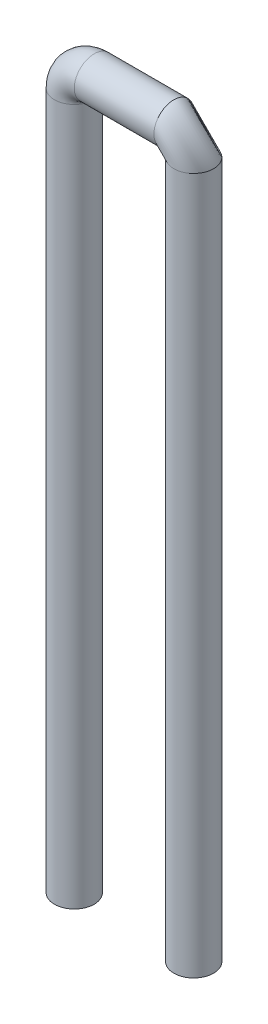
from build123d import *

# Parameters (mm, degrees)
ESQUISSE2_R = 0.5


with BuildPart() as part:
    # Balayage1: sweep along a path in Esquisse1
    with BuildLine(Plane.XY) as balayage1_path:
        Line((0, 0), (0, 17.5))
        ThreePointArc((0, 17.5), (0.146446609, 17.853553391), (0.5, 18))
        Line((0.5, 18), (2.5, 18))
        ThreePointArc((2.5, 18), (2.853553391, 17.853553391), (3, 17.5))
        Line((3, 17.5), (3, 0))
    # Esquisse2 → Balayage1 (sweep)
    with BuildSketch(Plane(origin=(0, 0, 0), x_dir=(1, 0, 0), z_dir=(0, 1, 0))):
        Circle(ESQUISSE2_R)
    sweep(path=balayage1_path.line)


solid = part.part
